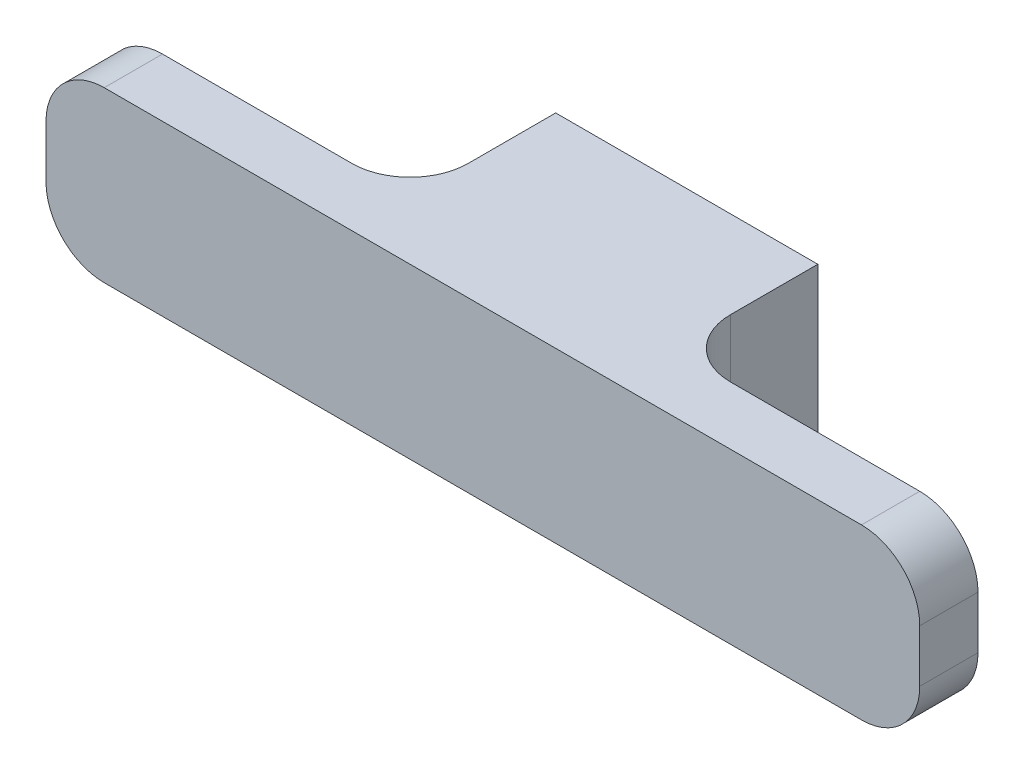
from build123d import *

# Parameters (mm, degrees)
CROQUIS1_W              = 4.5
CROQUIS1_H              = 2.9
SALIENTE_EXTRUIR1_DEPTH = 2.5
CROQUIS2_W              = 15
CROQUIS2_H              = 2.9
SALIENTE_EXTRUIR2_DEPTH = 1
REDONDEO1_R             = 1
REDONDEO2_R             = 1


with BuildPart() as part:
    # Croquis1 → Saliente-Extruir1 (new body)
    with BuildSketch(Plane.XY):
        Rectangle(CROQUIS1_W, CROQUIS1_H)
    extrude(amount=SALIENTE_EXTRUIR1_DEPTH)

    # Croquis2 → Saliente-Extruir2 (add)
    with BuildSketch(Plane.XY.offset(2.5)):
        Rectangle(CROQUIS2_W, CROQUIS2_H)
    extrude(amount=SALIENTE_EXTRUIR2_DEPTH)

    # Redondeo1
    redondeo1_edges = [part.edges().sort_by_distance(p)[0] for p in [
        (-2.25, 0, 2.5),
        (2.25, 0, 2.5),
    ]]
    fillet(redondeo1_edges, radius=REDONDEO1_R)

    # Redondeo2
    redondeo2_edges = [part.edges().sort_by_distance(p)[0] for p in [
        (-7.5, 1.45, 3),
        (-7.5, -1.45, 3),
        (7.5, -1.45, 3),
        (7.5, 1.45, 3),
    ]]
    fillet(redondeo2_edges, radius=REDONDEO2_R)


solid = part.part
